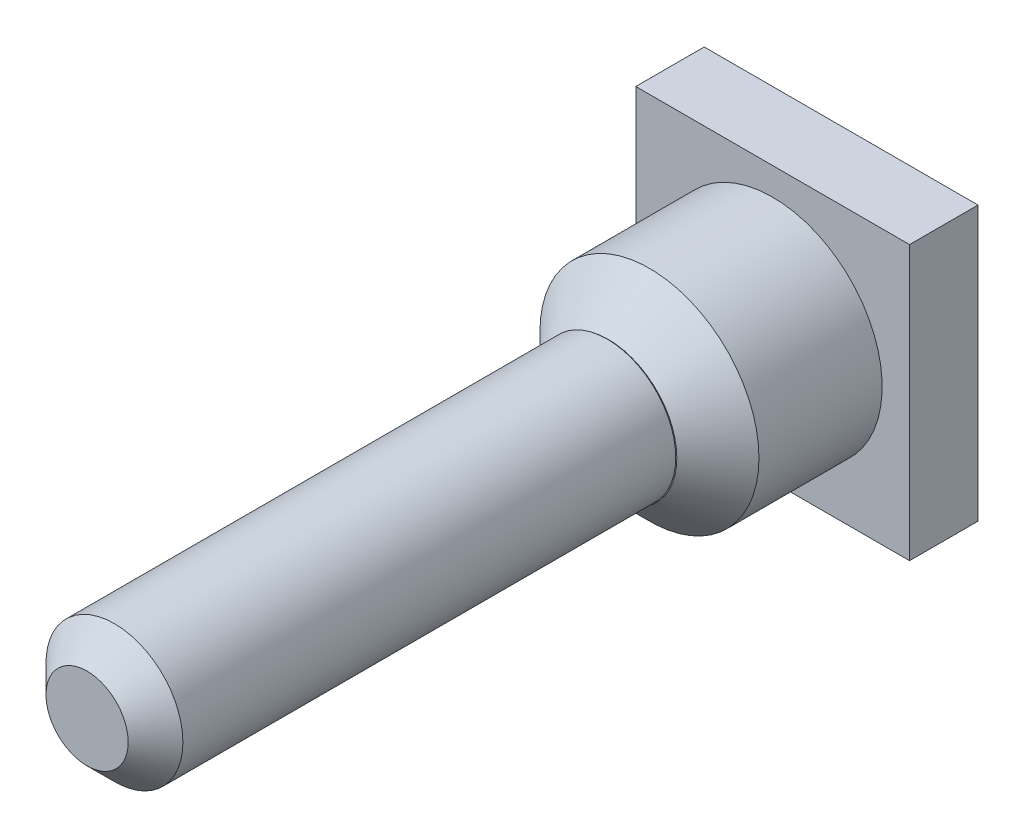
ISO-10303-21;
HEADER;
FILE_DESCRIPTION(('STEP AP214'),'2;1');
FILE_NAME('part.step','',(''),(''),'','','');
FILE_SCHEMA(('AUTOMOTIVE_DESIGN { 1 0 10303 214 1 1 1 1 }'));
ENDSEC;
DATA;
#1=APPLICATION_CONTEXT('core data for automotive mechanical design processes');
#2=APPLICATION_PROTOCOL_DEFINITION('international standard','automotive_design',2000,#1);
#3=PRODUCT_CONTEXT('',#1,'mechanical');
#4=PRODUCT('Part','Part','',(#3));
#5=PRODUCT_RELATED_PRODUCT_CATEGORY('part','',(#4));
#6=PRODUCT_DEFINITION_FORMATION('','',#4);
#7=PRODUCT_DEFINITION_CONTEXT('part definition',#1,'design');
#8=PRODUCT_DEFINITION('design','',#6,#7);
#9=PRODUCT_DEFINITION_SHAPE('','',#8);
#10=(LENGTH_UNIT() NAMED_UNIT(*) SI_UNIT(.MILLI.,.METRE.));
#11=(NAMED_UNIT(*) PLANE_ANGLE_UNIT() SI_UNIT($,.RADIAN.));
#12=(NAMED_UNIT(*) SI_UNIT($,.STERADIAN.) SOLID_ANGLE_UNIT());
#13=UNCERTAINTY_MEASURE_WITH_UNIT(LENGTH_MEASURE(1.E-05),#10,'distance_accuracy_value','');
#14=(GEOMETRIC_REPRESENTATION_CONTEXT(3) GLOBAL_UNCERTAINTY_ASSIGNED_CONTEXT((#13)) GLOBAL_UNIT_ASSIGNED_CONTEXT((#10,
#11,#12)) REPRESENTATION_CONTEXT('',''));
#15=CARTESIAN_POINT('',(0.,0.,0.));
#16=DIRECTION('',(0.,0.,1.));
#17=DIRECTION('',(1.,0.,0.));
#18=AXIS2_PLACEMENT_3D('',#15,#16,#17);
#19=CARTESIAN_POINT('',(0.,20.,5.));
#20=DIRECTION('',(0.,0.,-1.));
#21=DIRECTION('',(-1.,0.,0.));
#22=AXIS2_PLACEMENT_3D('',#19,#20,#21);
#23=PLANE('',#22);
#24=DIRECTION('',(0.,-1.,0.));
#25=VECTOR('',#24,1.);
#26=CARTESIAN_POINT('',(0.,0.,5.));
#27=LINE('',#26,#25);
#28=CARTESIAN_POINT('',(0.,20.,5.));
#29=VERTEX_POINT('',#28);
#30=CARTESIAN_POINT('',(0.,0.,5.));
#31=VERTEX_POINT('',#30);
#32=EDGE_CURVE('E90',#29,#31,#27,.T.);
#33=ORIENTED_EDGE('',*,*,#32,.T.);
#34=DIRECTION('',(1.,0.,0.));
#35=VECTOR('',#34,1.);
#36=CARTESIAN_POINT('',(0.,0.,5.));
#37=LINE('',#36,#35);
#38=CARTESIAN_POINT('',(20.,0.,5.));
#39=VERTEX_POINT('',#38);
#40=EDGE_CURVE('E92',#31,#39,#37,.T.);
#41=ORIENTED_EDGE('',*,*,#40,.T.);
#42=DIRECTION('',(0.,1.,0.));
#43=VECTOR('',#42,1.);
#44=CARTESIAN_POINT('',(20.,0.,5.));
#45=LINE('',#44,#43);
#46=CARTESIAN_POINT('',(20.,20.,5.));
#47=VERTEX_POINT('',#46);
#48=EDGE_CURVE('E94',#39,#47,#45,.T.);
#49=ORIENTED_EDGE('',*,*,#48,.T.);
#50=DIRECTION('',(-1.,0.,0.));
#51=VECTOR('',#50,1.);
#52=CARTESIAN_POINT('',(0.,20.,5.));
#53=LINE('',#52,#51);
#54=EDGE_CURVE('E39',#47,#29,#53,.T.);
#55=ORIENTED_EDGE('',*,*,#54,.T.);
#56=EDGE_LOOP('',(#33,#41,#49,#55));
#57=FACE_BOUND('',#56,.T.);
#58=CARTESIAN_POINT('',(10.,10.,5.));
#59=DIRECTION('',(0.,0.,-1.));
#60=DIRECTION('',(-1.,0.,0.));
#61=AXIS2_PLACEMENT_3D('',#58,#59,#60);
#62=CIRCLE('',#61,8.);
#63=CARTESIAN_POINT('',(2.,10.,5.));
#64=VERTEX_POINT('',#63);
#65=EDGE_CURVE('E74',#64,#64,#62,.F.);
#66=ORIENTED_EDGE('',*,*,#65,.F.);
#67=EDGE_LOOP('',(#66));
#68=FACE_BOUND('',#67,.T.);
#69=ADVANCED_FACE('F17',(#57,#68),#23,.F.);
#70=CARTESIAN_POINT('',(0.,0.,5.));
#71=DIRECTION('',(1.,0.,0.));
#72=DIRECTION('',(0.,0.,-1.));
#73=AXIS2_PLACEMENT_3D('',#70,#71,#72);
#74=PLANE('',#73);
#75=DIRECTION('',(0.,-1.,0.));
#76=VECTOR('',#75,1.);
#77=CARTESIAN_POINT('',(0.,0.,0.));
#78=LINE('',#77,#76);
#79=CARTESIAN_POINT('',(0.,20.,0.));
#80=VERTEX_POINT('',#79);
#81=CARTESIAN_POINT('',(0.,0.,0.));
#82=VERTEX_POINT('',#81);
#83=EDGE_CURVE('E80',#80,#82,#78,.T.);
#84=ORIENTED_EDGE('',*,*,#83,.T.);
#85=DIRECTION('',(0.,0.,-1.));
#86=VECTOR('',#85,1.);
#87=CARTESIAN_POINT('',(0.,0.,5.));
#88=LINE('',#87,#86);
#89=EDGE_CURVE('E106',#31,#82,#88,.T.);
#90=ORIENTED_EDGE('',*,*,#89,.F.);
#91=ORIENTED_EDGE('',*,*,#32,.F.);
#92=DIRECTION('',(0.,0.,-1.));
#93=VECTOR('',#92,1.);
#94=CARTESIAN_POINT('',(0.,20.,5.));
#95=LINE('',#94,#93);
#96=EDGE_CURVE('E97',#29,#80,#95,.T.);
#97=ORIENTED_EDGE('',*,*,#96,.T.);
#98=EDGE_LOOP('',(#84,#90,#91,#97));
#99=FACE_BOUND('',#98,.T.);
#100=ADVANCED_FACE('F19',(#99),#74,.F.);
#101=CARTESIAN_POINT('',(0.,0.,5.));
#102=DIRECTION('',(0.,1.,0.));
#103=DIRECTION('',(0.,0.,1.));
#104=AXIS2_PLACEMENT_3D('',#101,#102,#103);
#105=PLANE('',#104);
#106=DIRECTION('',(1.,0.,0.));
#107=VECTOR('',#106,1.);
#108=CARTESIAN_POINT('',(0.,0.,0.));
#109=LINE('',#108,#107);
#110=CARTESIAN_POINT('',(20.,0.,0.));
#111=VERTEX_POINT('',#110);
#112=EDGE_CURVE('E82',#82,#111,#109,.T.);
#113=ORIENTED_EDGE('',*,*,#112,.T.);
#114=DIRECTION('',(0.,0.,-1.));
#115=VECTOR('',#114,1.);
#116=CARTESIAN_POINT('',(20.,0.,5.));
#117=LINE('',#116,#115);
#118=EDGE_CURVE('E103',#39,#111,#117,.T.);
#119=ORIENTED_EDGE('',*,*,#118,.F.);
#120=ORIENTED_EDGE('',*,*,#40,.F.);
#121=ORIENTED_EDGE('',*,*,#89,.T.);
#122=EDGE_LOOP('',(#113,#119,#120,#121));
#123=FACE_BOUND('',#122,.T.);
#124=ADVANCED_FACE('F133',(#123),#105,.F.);
#125=CARTESIAN_POINT('',(20.,0.,5.));
#126=DIRECTION('',(-1.,0.,0.));
#127=DIRECTION('',(0.,-1.,0.));
#128=AXIS2_PLACEMENT_3D('',#125,#126,#127);
#129=PLANE('',#128);
#130=DIRECTION('',(0.,1.,0.));
#131=VECTOR('',#130,1.);
#132=CARTESIAN_POINT('',(20.,0.,0.));
#133=LINE('',#132,#131);
#134=CARTESIAN_POINT('',(20.,20.,0.));
#135=VERTEX_POINT('',#134);
#136=EDGE_CURVE('E86',#111,#135,#133,.T.);
#137=ORIENTED_EDGE('',*,*,#136,.T.);
#138=DIRECTION('',(0.,0.,-1.));
#139=VECTOR('',#138,1.);
#140=CARTESIAN_POINT('',(20.,20.,5.));
#141=LINE('',#140,#139);
#142=EDGE_CURVE('E100',#47,#135,#141,.T.);
#143=ORIENTED_EDGE('',*,*,#142,.F.);
#144=ORIENTED_EDGE('',*,*,#48,.F.);
#145=ORIENTED_EDGE('',*,*,#118,.T.);
#146=EDGE_LOOP('',(#137,#143,#144,#145));
#147=FACE_BOUND('',#146,.T.);
#148=ADVANCED_FACE('F143',(#147),#129,.F.);
#149=CARTESIAN_POINT('',(0.,20.,5.));
#150=DIRECTION('',(0.,-1.,0.));
#151=DIRECTION('',(0.,0.,-1.));
#152=AXIS2_PLACEMENT_3D('',#149,#150,#151);
#153=PLANE('',#152);
#154=DIRECTION('',(-1.,0.,0.));
#155=VECTOR('',#154,1.);
#156=CARTESIAN_POINT('',(0.,20.,0.));
#157=LINE('',#156,#155);
#158=EDGE_CURVE('E88',#135,#80,#157,.T.);
#159=ORIENTED_EDGE('',*,*,#158,.T.);
#160=ORIENTED_EDGE('',*,*,#96,.F.);
#161=ORIENTED_EDGE('',*,*,#54,.F.);
#162=ORIENTED_EDGE('',*,*,#142,.T.);
#163=EDGE_LOOP('',(#159,#160,#161,#162));
#164=FACE_BOUND('',#163,.T.);
#165=ADVANCED_FACE('F140',(#164),#153,.F.);
#166=CARTESIAN_POINT('',(0.,20.,0.));
#167=DIRECTION('',(0.,0.,-1.));
#168=DIRECTION('',(-1.,0.,0.));
#169=AXIS2_PLACEMENT_3D('',#166,#167,#168);
#170=PLANE('',#169);
#171=ORIENTED_EDGE('',*,*,#83,.F.);
#172=ORIENTED_EDGE('',*,*,#158,.F.);
#173=ORIENTED_EDGE('',*,*,#136,.F.);
#174=ORIENTED_EDGE('',*,*,#112,.F.);
#175=EDGE_LOOP('',(#171,#172,#173,#174));
#176=FACE_BOUND('',#175,.T.);
#177=ADVANCED_FACE('F138',(#176),#170,.T.);
#178=CARTESIAN_POINT('',(10.,10.,17.));
#179=DIRECTION('',(0.,0.,-1.));
#180=DIRECTION('',(-1.,0.,0.));
#181=AXIS2_PLACEMENT_3D('',#178,#179,#180);
#182=CYLINDRICAL_SURFACE('',#181,8.);
#183=CARTESIAN_POINT('',(10.,10.,14.));
#184=DIRECTION('',(0.,0.,1.));
#185=DIRECTION('',(1.,0.,0.));
#186=AXIS2_PLACEMENT_3D('',#183,#184,#185);
#187=CIRCLE('',#186,8.);
#188=CARTESIAN_POINT('',(18.,10.,14.));
#189=VERTEX_POINT('',#188);
#190=EDGE_CURVE('E71',#189,#189,#187,.F.);
#191=ORIENTED_EDGE('',*,*,#190,.T.);
#192=EDGE_LOOP('',(#191));
#193=FACE_BOUND('',#192,.T.);
#194=ORIENTED_EDGE('',*,*,#65,.T.);
#195=EDGE_LOOP('',(#194));
#196=FACE_BOUND('',#195,.T.);
#197=ADVANCED_FACE('F161',(#193,#196),#182,.T.);
#198=CARTESIAN_POINT('',(10.,10.,17.));
#199=DIRECTION('',(0.,0.,1.));
#200=DIRECTION('',(1.,0.,0.));
#201=AXIS2_PLACEMENT_3D('',#198,#199,#200);
#202=PLANE('',#201);
#203=CARTESIAN_POINT('',(9.920116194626,9.98002904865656,17.));
#204=DIRECTION('',(0.,0.,1.));
#205=DIRECTION('',(1.,0.,0.));
#206=AXIS2_PLACEMENT_3D('',#203,#204,#205);
#207=CIRCLE('',#206,5.);
#208=CARTESIAN_POINT('',(11.1726951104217,5.13946647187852,17.));
#209=VERTEX_POINT('',#208);
#210=CARTESIAN_POINT('',(8.74742108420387,14.8405625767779,17.));
#211=VERTEX_POINT('',#210);
#212=EDGE_CURVE('E31',#209,#211,#207,.T.);
#213=ORIENTED_EDGE('',*,*,#212,.F.);
#214=CARTESIAN_POINT('',(10.,10.,17.));
#215=DIRECTION('',(0.,0.,1.));
#216=DIRECTION('',(1.,0.,0.));
#217=AXIS2_PLACEMENT_3D('',#214,#215,#216);
#218=CIRCLE('',#217,5.);
#219=EDGE_CURVE('E67',#209,#211,#218,.T.);
#220=ORIENTED_EDGE('',*,*,#219,.T.);
#221=EDGE_LOOP('',(#213,#220));
#222=FACE_BOUND('',#221,.T.);
#223=ADVANCED_FACE('F73',(#222),#202,.T.);
#224=CARTESIAN_POINT('',(10.,10.,17.));
#225=DIRECTION('',(0.,0.,-1.));
#226=DIRECTION('',(-1.,0.,0.));
#227=AXIS2_PLACEMENT_3D('',#224,#225,#226);
#228=CONICAL_SURFACE('',#227,5.,0.785398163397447);
#229=ORIENTED_EDGE('',*,*,#190,.F.);
#230=EDGE_LOOP('',(#229));
#231=FACE_BOUND('',#230,.T.);
#232=EDGE_CURVE('E65',#211,#209,#218,.T.);
#233=ORIENTED_EDGE('',*,*,#232,.F.);
#234=ORIENTED_EDGE('',*,*,#219,.F.);
#235=EDGE_LOOP('',(#233,#234));
#236=FACE_BOUND('',#235,.T.);
#237=ADVANCED_FACE('F66',(#231,#236),#228,.T.);
#238=CARTESIAN_POINT('',(9.920116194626,9.98002904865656,17.));
#239=DIRECTION('',(0.,0.,1.));
#240=DIRECTION('',(1.,0.,0.));
#241=AXIS2_PLACEMENT_3D('',#238,#239,#240);
#242=PLANE('',#241);
#243=EDGE_CURVE('E77',#211,#209,#207,.T.);
#244=ORIENTED_EDGE('',*,*,#243,.F.);
#245=ORIENTED_EDGE('',*,*,#232,.T.);
#246=EDGE_LOOP('',(#244,#245));
#247=FACE_BOUND('',#246,.T.);
#248=ADVANCED_FACE('F79',(#247),#242,.F.);
#249=CARTESIAN_POINT('',(9.920116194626,9.98002904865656,55.));
#250=DIRECTION('',(0.,0.,-1.));
#251=DIRECTION('',(-1.,0.,0.));
#252=AXIS2_PLACEMENT_3D('',#249,#250,#251);
#253=CYLINDRICAL_SURFACE('',#252,5.);
#254=CARTESIAN_POINT('',(9.920116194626,9.98002904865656,53.));
#255=DIRECTION('',(0.,0.,1.));
#256=DIRECTION('',(1.,0.,0.));
#257=AXIS2_PLACEMENT_3D('',#254,#255,#256);
#258=CIRCLE('',#257,5.);
#259=CARTESIAN_POINT('',(14.920116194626,9.98002904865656,53.));
#260=VERTEX_POINT('',#259);
#261=EDGE_CURVE('E11',#260,#260,#258,.F.);
#262=ORIENTED_EDGE('',*,*,#261,.T.);
#263=EDGE_LOOP('',(#262));
#264=FACE_BOUND('',#263,.T.);
#265=ORIENTED_EDGE('',*,*,#243,.T.);
#266=ORIENTED_EDGE('',*,*,#212,.T.);
#267=EDGE_LOOP('',(#265,#266));
#268=FACE_BOUND('',#267,.T.);
#269=ADVANCED_FACE('F76',(#264,#268),#253,.T.);
#270=CARTESIAN_POINT('',(9.920116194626,9.98002904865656,55.));
#271=DIRECTION('',(0.,0.,1.));
#272=DIRECTION('',(1.,0.,0.));
#273=AXIS2_PLACEMENT_3D('',#270,#271,#272);
#274=PLANE('',#273);
#275=CARTESIAN_POINT('',(9.920116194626,9.98002904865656,55.));
#276=DIRECTION('',(0.,0.,1.));
#277=DIRECTION('',(1.,0.,0.));
#278=AXIS2_PLACEMENT_3D('',#275,#276,#277);
#279=CIRCLE('',#278,3.);
#280=CARTESIAN_POINT('',(12.920116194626,9.98002904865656,55.));
#281=VERTEX_POINT('',#280);
#282=EDGE_CURVE('E25',#281,#281,#279,.T.);
#283=ORIENTED_EDGE('',*,*,#282,.T.);
#284=EDGE_LOOP('',(#283));
#285=FACE_BOUND('',#284,.T.);
#286=ADVANCED_FACE('F115',(#285),#274,.T.);
#287=CARTESIAN_POINT('',(9.920116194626,9.98002904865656,55.));
#288=DIRECTION('',(0.,0.,-1.));
#289=DIRECTION('',(-1.,0.,0.));
#290=AXIS2_PLACEMENT_3D('',#287,#288,#289);
#291=CONICAL_SURFACE('',#290,3.,0.785398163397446);
#292=ORIENTED_EDGE('',*,*,#261,.F.);
#293=EDGE_LOOP('',(#292));
#294=FACE_BOUND('',#293,.T.);
#295=ORIENTED_EDGE('',*,*,#282,.F.);
#296=EDGE_LOOP('',(#295));
#297=FACE_BOUND('',#296,.T.);
#298=ADVANCED_FACE('F117',(#294,#297),#291,.T.);
#299=CLOSED_SHELL('',(#69,#100,#124,#148,#165,#177,#197,#223,#237,#248,#269,#286,#298));
#300=MANIFOLD_SOLID_BREP('B1',#299);
#301=ADVANCED_BREP_SHAPE_REPRESENTATION('',(#18,#300),#14);
#302=SHAPE_DEFINITION_REPRESENTATION(#9,#301);
ENDSEC;
END-ISO-10303-21;
